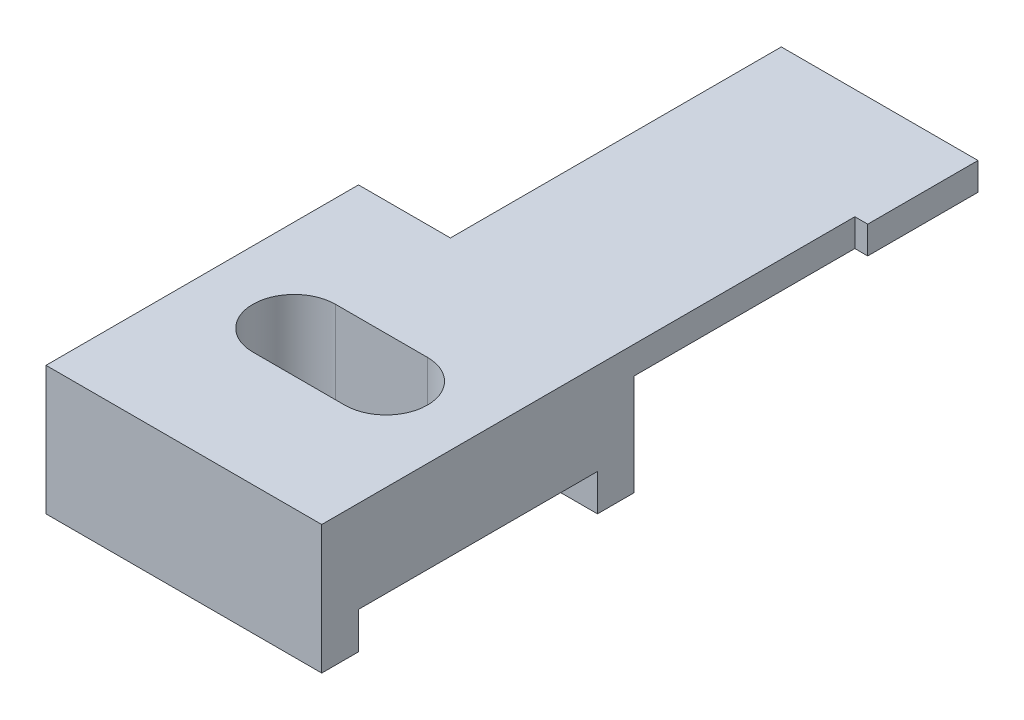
from build123d import *

# Parameters (mm, degrees)
EXTRUDE_1_DEPTH     = 35
SKETCH_2_OUTSIDE_W  = 44.798
SKETCH_2_OUTSIDE_H  = 16.798
CUT_EXTRUDE_1_DEPTH = 35
SKETCH_3_OUTSIDE_W  = 25.498
SKETCH_3_OUTSIDE_H  = 44.798
CUT_EXTRUDE_2_DEPTH = 35


with BuildPart() as part:
    # Sketch 1 → Extrude 1 (new body)
    with BuildSketch(Plane.XY):
        Polygon((15.7, 5.5), (15.7, 7), (0, 7), (0, 0), (15, 0), (15, 5.5), align=None)
    extrude(amount=EXTRUDE_1_DEPTH)

    # Sketch 2 outside → Cut-Extrude 1 (cut)
    with BuildSketch(Plane(origin=(15.7, 0, 0), x_dir=(0, 0, -1), z_dir=(1, 0, 0))):
        with Locations((-17.5, 3.5)):
            Rectangle(SKETCH_2_OUTSIDE_W, SKETCH_2_OUTSIDE_H)
        Polygon((-18, 5.5), (0, 5.5), (0, 7), (-35, 7), (-35, 0), (-33, 0), (-33, 2), (-20, 2), (-20, 0), (-18, 0), align=None, mode=Mode.SUBTRACT)
    extrude(amount=-CUT_EXTRUDE_1_DEPTH, mode=Mode.SUBTRACT)

    # Sketch 3 outside → Cut-Extrude 2 (cut)
    # profile 1 of 2: a face of its own
    with BuildSketch(Plane(origin=(0, 7, 0), x_dir=(1, 0, 0), z_dir=(0, 1, 0))):
        with Locations((7.85, -17.5)):
            Rectangle(SKETCH_3_OUTSIDE_W, SKETCH_3_OUTSIDE_H)
        Polygon((15, -35), (15, -6), (15.7, -6), (15.7, 0), (5, 0), (5, -18), (0, -18), (0, -35), align=None, mode=Mode.SUBTRACT)
    # profile 2 of 2: a face of its own
    with BuildSketch(Plane(origin=(0, 7, 0), x_dir=(1, 0, 0), z_dir=(0, 1, 0))):
        with BuildLine():
            Line((10, -24.25), (5, -24.25))
            ThreePointArc((5, -24.25), (2.75, -26.5), (5, -28.75))
            Line((5, -28.75), (10, -28.75))
            ThreePointArc((10, -28.75), (12.25, -26.5), (10, -24.25))
        make_face()
    extrude(amount=-CUT_EXTRUDE_2_DEPTH, mode=Mode.SUBTRACT)


solid = part.part
